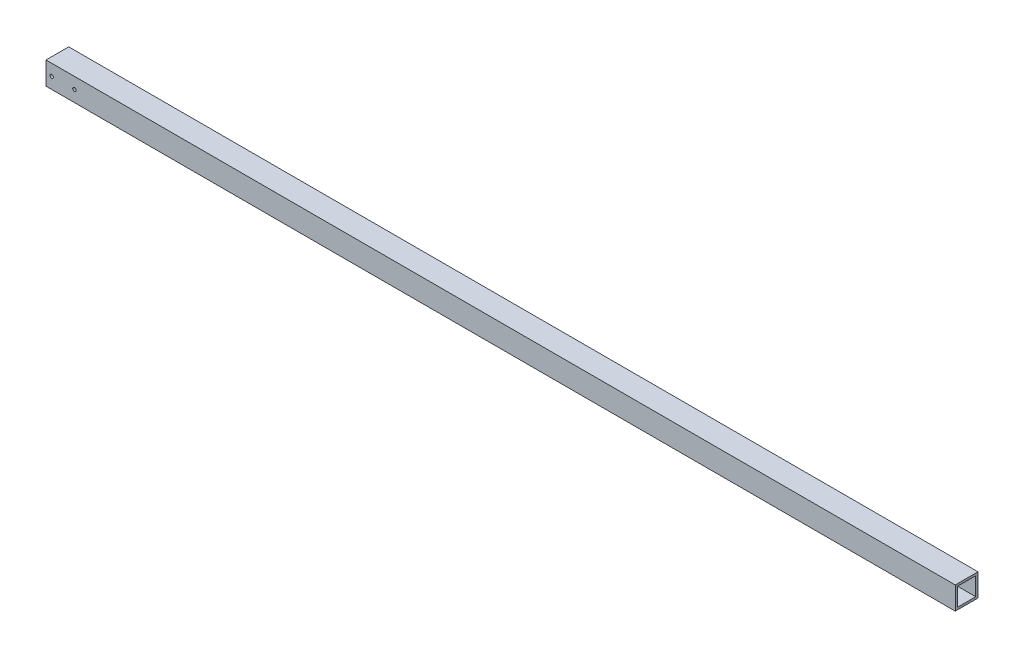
ISO-10303-21;
HEADER;
FILE_DESCRIPTION(('STEP AP214'),'2;1');
FILE_NAME('part.step','',(''),(''),'','','');
FILE_SCHEMA(('AUTOMOTIVE_DESIGN { 1 0 10303 214 1 1 1 1 }'));
ENDSEC;
DATA;
#1=APPLICATION_CONTEXT('core data for automotive mechanical design processes');
#2=APPLICATION_PROTOCOL_DEFINITION('international standard','automotive_design',2000,#1);
#3=PRODUCT_CONTEXT('',#1,'mechanical');
#4=PRODUCT('Part','Part','',(#3));
#5=PRODUCT_RELATED_PRODUCT_CATEGORY('part','',(#4));
#6=PRODUCT_DEFINITION_FORMATION('','',#4);
#7=PRODUCT_DEFINITION_CONTEXT('part definition',#1,'design');
#8=PRODUCT_DEFINITION('design','',#6,#7);
#9=PRODUCT_DEFINITION_SHAPE('','',#8);
#10=(LENGTH_UNIT() NAMED_UNIT(*) SI_UNIT(.MILLI.,.METRE.));
#11=(NAMED_UNIT(*) PLANE_ANGLE_UNIT() SI_UNIT($,.RADIAN.));
#12=(NAMED_UNIT(*) SI_UNIT($,.STERADIAN.) SOLID_ANGLE_UNIT());
#13=UNCERTAINTY_MEASURE_WITH_UNIT(LENGTH_MEASURE(1.E-05),#10,'distance_accuracy_value','');
#14=(GEOMETRIC_REPRESENTATION_CONTEXT(3) GLOBAL_UNCERTAINTY_ASSIGNED_CONTEXT((#13)) GLOBAL_UNIT_ASSIGNED_CONTEXT((#10,
#11,#12)) REPRESENTATION_CONTEXT('',''));
#15=CARTESIAN_POINT('',(0.,0.,0.));
#16=DIRECTION('',(0.,0.,1.));
#17=DIRECTION('',(1.,0.,0.));
#18=AXIS2_PLACEMENT_3D('',#15,#16,#17);
#19=CARTESIAN_POINT('',(800.,10.,-9.99999999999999));
#20=DIRECTION('',(-1.,0.,0.));
#21=DIRECTION('',(0.,0.,1.));
#22=AXIS2_PLACEMENT_3D('',#19,#20,#21);
#23=PLANE('',#22);
#24=DIRECTION('',(0.,1.,0.));
#25=VECTOR('',#24,1.);
#26=CARTESIAN_POINT('',(800.,-10.,-9.99999999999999));
#27=LINE('',#26,#25);
#28=CARTESIAN_POINT('',(800.,-10.,-9.99999999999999));
#29=VERTEX_POINT('',#28);
#30=CARTESIAN_POINT('',(800.,10.,-9.99999999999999));
#31=VERTEX_POINT('',#30);
#32=EDGE_CURVE('E136',#29,#31,#27,.T.);
#33=ORIENTED_EDGE('',*,*,#32,.T.);
#34=DIRECTION('',(0.,0.,1.));
#35=VECTOR('',#34,1.);
#36=CARTESIAN_POINT('',(800.,10.,10.));
#37=LINE('',#36,#35);
#38=CARTESIAN_POINT('',(800.,10.,10.));
#39=VERTEX_POINT('',#38);
#40=EDGE_CURVE('E139',#31,#39,#37,.T.);
#41=ORIENTED_EDGE('',*,*,#40,.T.);
#42=DIRECTION('',(0.,-1.,0.));
#43=VECTOR('',#42,1.);
#44=CARTESIAN_POINT('',(800.,-10.,10.));
#45=LINE('',#44,#43);
#46=CARTESIAN_POINT('',(800.,-10.,10.));
#47=VERTEX_POINT('',#46);
#48=EDGE_CURVE('E142',#39,#47,#45,.T.);
#49=ORIENTED_EDGE('',*,*,#48,.T.);
#50=DIRECTION('',(0.,0.,-1.));
#51=VECTOR('',#50,1.);
#52=CARTESIAN_POINT('',(800.,-10.,10.));
#53=LINE('',#52,#51);
#54=EDGE_CURVE('E144',#47,#29,#53,.T.);
#55=ORIENTED_EDGE('',*,*,#54,.T.);
#56=EDGE_LOOP('',(#33,#41,#49,#55));
#57=FACE_BOUND('',#56,.T.);
#58=DIRECTION('',(0.,1.,0.));
#59=VECTOR('',#58,1.);
#60=CARTESIAN_POINT('',(800.,-8.,-8.));
#61=LINE('',#60,#59);
#62=CARTESIAN_POINT('',(800.,-8.,-8.));
#63=VERTEX_POINT('',#62);
#64=CARTESIAN_POINT('',(800.,8.,-8.));
#65=VERTEX_POINT('',#64);
#66=EDGE_CURVE('E98',#63,#65,#61,.T.);
#67=ORIENTED_EDGE('',*,*,#66,.F.);
#68=DIRECTION('',(0.,0.,-1.));
#69=VECTOR('',#68,1.);
#70=CARTESIAN_POINT('',(800.,-8.,8.));
#71=LINE('',#70,#69);
#72=CARTESIAN_POINT('',(800.,-8.,8.));
#73=VERTEX_POINT('',#72);
#74=EDGE_CURVE('E120',#73,#63,#71,.T.);
#75=ORIENTED_EDGE('',*,*,#74,.F.);
#76=DIRECTION('',(0.,-1.,0.));
#77=VECTOR('',#76,1.);
#78=CARTESIAN_POINT('',(800.,-8.,8.));
#79=LINE('',#78,#77);
#80=CARTESIAN_POINT('',(800.,8.,8.));
#81=VERTEX_POINT('',#80);
#82=EDGE_CURVE('E118',#81,#73,#79,.T.);
#83=ORIENTED_EDGE('',*,*,#82,.F.);
#84=DIRECTION('',(0.,0.,1.));
#85=VECTOR('',#84,1.);
#86=CARTESIAN_POINT('',(800.,8.,8.));
#87=LINE('',#86,#85);
#88=EDGE_CURVE('E106',#65,#81,#87,.T.);
#89=ORIENTED_EDGE('',*,*,#88,.F.);
#90=EDGE_LOOP('',(#67,#75,#83,#89));
#91=FACE_BOUND('',#90,.T.);
#92=ADVANCED_FACE('F31',(#57,#91),#23,.F.);
#93=CARTESIAN_POINT('',(0.,10.,-9.99999999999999));
#94=DIRECTION('',(-1.,0.,0.));
#95=DIRECTION('',(0.,0.,1.));
#96=AXIS2_PLACEMENT_3D('',#93,#94,#95);
#97=PLANE('',#96);
#98=DIRECTION('',(0.,1.,0.));
#99=VECTOR('',#98,1.);
#100=CARTESIAN_POINT('',(0.,-10.,-9.99999999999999));
#101=LINE('',#100,#99);
#102=CARTESIAN_POINT('',(0.,-10.,-9.99999999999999));
#103=VERTEX_POINT('',#102);
#104=CARTESIAN_POINT('',(0.,10.,-9.99999999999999));
#105=VERTEX_POINT('',#104);
#106=EDGE_CURVE('E114',#103,#105,#101,.T.);
#107=ORIENTED_EDGE('',*,*,#106,.F.);
#108=DIRECTION('',(0.,0.,-1.));
#109=VECTOR('',#108,1.);
#110=CARTESIAN_POINT('',(0.,-10.,10.));
#111=LINE('',#110,#109);
#112=CARTESIAN_POINT('',(0.,-10.,10.));
#113=VERTEX_POINT('',#112);
#114=EDGE_CURVE('E140',#113,#103,#111,.T.);
#115=ORIENTED_EDGE('',*,*,#114,.F.);
#116=DIRECTION('',(0.,-1.,0.));
#117=VECTOR('',#116,1.);
#118=CARTESIAN_POINT('',(0.,-10.,10.));
#119=LINE('',#118,#117);
#120=CARTESIAN_POINT('',(0.,10.,10.));
#121=VERTEX_POINT('',#120);
#122=EDGE_CURVE('E151',#121,#113,#119,.T.);
#123=ORIENTED_EDGE('',*,*,#122,.F.);
#124=DIRECTION('',(0.,0.,1.));
#125=VECTOR('',#124,1.);
#126=CARTESIAN_POINT('',(0.,10.,10.));
#127=LINE('',#126,#125);
#128=EDGE_CURVE('E149',#105,#121,#127,.T.);
#129=ORIENTED_EDGE('',*,*,#128,.F.);
#130=EDGE_LOOP('',(#107,#115,#123,#129));
#131=FACE_BOUND('',#130,.T.);
#132=DIRECTION('',(0.,0.,-1.));
#133=VECTOR('',#132,1.);
#134=CARTESIAN_POINT('',(0.,-8.,8.));
#135=LINE('',#134,#133);
#136=CARTESIAN_POINT('',(0.,-8.,8.));
#137=VERTEX_POINT('',#136);
#138=CARTESIAN_POINT('',(0.,-8.,-8.));
#139=VERTEX_POINT('',#138);
#140=EDGE_CURVE('E107',#137,#139,#135,.T.);
#141=ORIENTED_EDGE('',*,*,#140,.T.);
#142=DIRECTION('',(0.,1.,0.));
#143=VECTOR('',#142,1.);
#144=CARTESIAN_POINT('',(0.,-8.,-8.));
#145=LINE('',#144,#143);
#146=CARTESIAN_POINT('',(0.,8.,-8.));
#147=VERTEX_POINT('',#146);
#148=EDGE_CURVE('E56',#139,#147,#145,.T.);
#149=ORIENTED_EDGE('',*,*,#148,.T.);
#150=DIRECTION('',(0.,0.,1.));
#151=VECTOR('',#150,1.);
#152=CARTESIAN_POINT('',(0.,8.,8.));
#153=LINE('',#152,#151);
#154=CARTESIAN_POINT('',(0.,8.,8.));
#155=VERTEX_POINT('',#154);
#156=EDGE_CURVE('E113',#147,#155,#153,.T.);
#157=ORIENTED_EDGE('',*,*,#156,.T.);
#158=DIRECTION('',(0.,-1.,0.));
#159=VECTOR('',#158,1.);
#160=CARTESIAN_POINT('',(0.,-8.,8.));
#161=LINE('',#160,#159);
#162=EDGE_CURVE('E128',#155,#137,#161,.T.);
#163=ORIENTED_EDGE('',*,*,#162,.T.);
#164=EDGE_LOOP('',(#141,#149,#157,#163));
#165=FACE_BOUND('',#164,.T.);
#166=ADVANCED_FACE('F198',(#131,#165),#97,.T.);
#167=CARTESIAN_POINT('',(800.,-10.,-9.99999999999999));
#168=DIRECTION('',(0.,0.,1.));
#169=DIRECTION('',(1.,0.,0.));
#170=AXIS2_PLACEMENT_3D('',#167,#168,#169);
#171=PLANE('',#170);
#172=CARTESIAN_POINT('',(25.,0.,-9.99999999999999));
#173=DIRECTION('',(0.,0.,1.));
#174=DIRECTION('',(1.,0.,0.));
#175=AXIS2_PLACEMENT_3D('',#172,#173,#174);
#176=CIRCLE('',#175,1.5);
#177=CARTESIAN_POINT('',(26.5,0.,-9.99999999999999));
#178=VERTEX_POINT('',#177);
#179=EDGE_CURVE('E180',#178,#178,#176,.T.);
#180=ORIENTED_EDGE('',*,*,#179,.T.);
#181=EDGE_LOOP('',(#180));
#182=FACE_BOUND('',#181,.T.);
#183=CARTESIAN_POINT('',(5.,0.,-9.99999999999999));
#184=DIRECTION('',(0.,0.,1.));
#185=DIRECTION('',(1.,0.,0.));
#186=AXIS2_PLACEMENT_3D('',#183,#184,#185);
#187=CIRCLE('',#186,1.5);
#188=CARTESIAN_POINT('',(6.5,0.,-9.99999999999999));
#189=VERTEX_POINT('',#188);
#190=EDGE_CURVE('E162',#189,#189,#187,.T.);
#191=ORIENTED_EDGE('',*,*,#190,.T.);
#192=EDGE_LOOP('',(#191));
#193=FACE_BOUND('',#192,.T.);
#194=ORIENTED_EDGE('',*,*,#106,.T.);
#195=DIRECTION('',(-1.,0.,0.));
#196=VECTOR('',#195,1.);
#197=CARTESIAN_POINT('',(800.,10.,-9.99999999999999));
#198=LINE('',#197,#196);
#199=EDGE_CURVE('E11',#31,#105,#198,.T.);
#200=ORIENTED_EDGE('',*,*,#199,.F.);
#201=ORIENTED_EDGE('',*,*,#32,.F.);
#202=DIRECTION('',(-1.,0.,0.));
#203=VECTOR('',#202,1.);
#204=CARTESIAN_POINT('',(800.,-10.,-9.99999999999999));
#205=LINE('',#204,#203);
#206=EDGE_CURVE('E146',#29,#103,#205,.T.);
#207=ORIENTED_EDGE('',*,*,#206,.T.);
#208=EDGE_LOOP('',(#194,#200,#201,#207));
#209=FACE_BOUND('',#208,.T.);
#210=ADVANCED_FACE('F33',(#182,#193,#209),#171,.F.);
#211=CARTESIAN_POINT('',(800.,10.,10.));
#212=DIRECTION('',(0.,-1.,0.));
#213=DIRECTION('',(0.,0.,-1.));
#214=AXIS2_PLACEMENT_3D('',#211,#212,#213);
#215=PLANE('',#214);
#216=ORIENTED_EDGE('',*,*,#128,.T.);
#217=DIRECTION('',(-1.,0.,0.));
#218=VECTOR('',#217,1.);
#219=CARTESIAN_POINT('',(800.,10.,10.));
#220=LINE('',#219,#218);
#221=EDGE_CURVE('E40',#39,#121,#220,.T.);
#222=ORIENTED_EDGE('',*,*,#221,.F.);
#223=ORIENTED_EDGE('',*,*,#40,.F.);
#224=ORIENTED_EDGE('',*,*,#199,.T.);
#225=EDGE_LOOP('',(#216,#222,#223,#224));
#226=FACE_BOUND('',#225,.T.);
#227=ADVANCED_FACE('F224',(#226),#215,.F.);
#228=CARTESIAN_POINT('',(800.,-10.,10.));
#229=DIRECTION('',(0.,0.,-1.));
#230=DIRECTION('',(-1.,0.,0.));
#231=AXIS2_PLACEMENT_3D('',#228,#229,#230);
#232=PLANE('',#231);
#233=CARTESIAN_POINT('',(25.,0.,10.));
#234=DIRECTION('',(0.,0.,1.));
#235=DIRECTION('',(1.,0.,0.));
#236=AXIS2_PLACEMENT_3D('',#233,#234,#235);
#237=CIRCLE('',#236,1.5);
#238=CARTESIAN_POINT('',(26.5,0.,10.));
#239=VERTEX_POINT('',#238);
#240=EDGE_CURVE('E177',#239,#239,#237,.T.);
#241=ORIENTED_EDGE('',*,*,#240,.F.);
#242=EDGE_LOOP('',(#241));
#243=FACE_BOUND('',#242,.T.);
#244=CARTESIAN_POINT('',(5.,0.,10.));
#245=DIRECTION('',(0.,0.,1.));
#246=DIRECTION('',(1.,0.,0.));
#247=AXIS2_PLACEMENT_3D('',#244,#245,#246);
#248=CIRCLE('',#247,1.5);
#249=CARTESIAN_POINT('',(6.5,0.,10.));
#250=VERTEX_POINT('',#249);
#251=EDGE_CURVE('E167',#250,#250,#248,.T.);
#252=ORIENTED_EDGE('',*,*,#251,.F.);
#253=EDGE_LOOP('',(#252));
#254=FACE_BOUND('',#253,.T.);
#255=ORIENTED_EDGE('',*,*,#122,.T.);
#256=DIRECTION('',(-1.,0.,0.));
#257=VECTOR('',#256,1.);
#258=CARTESIAN_POINT('',(800.,-10.,10.));
#259=LINE('',#258,#257);
#260=EDGE_CURVE('E156',#47,#113,#259,.T.);
#261=ORIENTED_EDGE('',*,*,#260,.F.);
#262=ORIENTED_EDGE('',*,*,#48,.F.);
#263=ORIENTED_EDGE('',*,*,#221,.T.);
#264=EDGE_LOOP('',(#255,#261,#262,#263));
#265=FACE_BOUND('',#264,.T.);
#266=ADVANCED_FACE('F221',(#243,#254,#265),#232,.F.);
#267=CARTESIAN_POINT('',(800.,-10.,10.));
#268=DIRECTION('',(0.,1.,0.));
#269=DIRECTION('',(0.,0.,1.));
#270=AXIS2_PLACEMENT_3D('',#267,#268,#269);
#271=PLANE('',#270);
#272=ORIENTED_EDGE('',*,*,#114,.T.);
#273=ORIENTED_EDGE('',*,*,#206,.F.);
#274=ORIENTED_EDGE('',*,*,#54,.F.);
#275=ORIENTED_EDGE('',*,*,#260,.T.);
#276=EDGE_LOOP('',(#272,#273,#274,#275));
#277=FACE_BOUND('',#276,.T.);
#278=ADVANCED_FACE('F218',(#277),#271,.F.);
#279=CARTESIAN_POINT('',(800.,-8.,-8.));
#280=DIRECTION('',(0.,0.,1.));
#281=DIRECTION('',(1.,0.,0.));
#282=AXIS2_PLACEMENT_3D('',#279,#280,#281);
#283=PLANE('',#282);
#284=CARTESIAN_POINT('',(25.,0.,-8.));
#285=DIRECTION('',(0.,0.,1.));
#286=DIRECTION('',(1.,0.,0.));
#287=AXIS2_PLACEMENT_3D('',#284,#285,#286);
#288=CIRCLE('',#287,1.5);
#289=CARTESIAN_POINT('',(26.5,0.,-8.));
#290=VERTEX_POINT('',#289);
#291=EDGE_CURVE('E172',#290,#290,#288,.T.);
#292=ORIENTED_EDGE('',*,*,#291,.F.);
#293=EDGE_LOOP('',(#292));
#294=FACE_BOUND('',#293,.T.);
#295=CARTESIAN_POINT('',(5.,0.,-8.));
#296=DIRECTION('',(0.,0.,1.));
#297=DIRECTION('',(1.,0.,0.));
#298=AXIS2_PLACEMENT_3D('',#295,#296,#297);
#299=CIRCLE('',#298,1.5);
#300=CARTESIAN_POINT('',(6.5,0.,-8.));
#301=VERTEX_POINT('',#300);
#302=EDGE_CURVE('E126',#301,#301,#299,.T.);
#303=ORIENTED_EDGE('',*,*,#302,.F.);
#304=EDGE_LOOP('',(#303));
#305=FACE_BOUND('',#304,.T.);
#306=ORIENTED_EDGE('',*,*,#148,.F.);
#307=DIRECTION('',(-1.,0.,0.));
#308=VECTOR('',#307,1.);
#309=CARTESIAN_POINT('',(800.,-8.,-8.));
#310=LINE('',#309,#308);
#311=EDGE_CURVE('E102',#63,#139,#310,.T.);
#312=ORIENTED_EDGE('',*,*,#311,.F.);
#313=ORIENTED_EDGE('',*,*,#66,.T.);
#314=DIRECTION('',(-1.,0.,0.));
#315=VECTOR('',#314,1.);
#316=CARTESIAN_POINT('',(800.,8.,-8.));
#317=LINE('',#316,#315);
#318=EDGE_CURVE('E101',#65,#147,#317,.T.);
#319=ORIENTED_EDGE('',*,*,#318,.T.);
#320=EDGE_LOOP('',(#306,#312,#313,#319));
#321=FACE_BOUND('',#320,.T.);
#322=ADVANCED_FACE('F100',(#294,#305,#321),#283,.T.);
#323=CARTESIAN_POINT('',(800.,8.,8.));
#324=DIRECTION('',(0.,-1.,0.));
#325=DIRECTION('',(0.,0.,-1.));
#326=AXIS2_PLACEMENT_3D('',#323,#324,#325);
#327=PLANE('',#326);
#328=ORIENTED_EDGE('',*,*,#156,.F.);
#329=ORIENTED_EDGE('',*,*,#318,.F.);
#330=ORIENTED_EDGE('',*,*,#88,.T.);
#331=DIRECTION('',(-1.,0.,0.));
#332=VECTOR('',#331,1.);
#333=CARTESIAN_POINT('',(800.,8.,8.));
#334=LINE('',#333,#332);
#335=EDGE_CURVE('E115',#81,#155,#334,.T.);
#336=ORIENTED_EDGE('',*,*,#335,.T.);
#337=EDGE_LOOP('',(#328,#329,#330,#336));
#338=FACE_BOUND('',#337,.T.);
#339=ADVANCED_FACE('F110',(#338),#327,.T.);
#340=CARTESIAN_POINT('',(800.,-8.,8.));
#341=DIRECTION('',(0.,0.,-1.));
#342=DIRECTION('',(-1.,0.,0.));
#343=AXIS2_PLACEMENT_3D('',#340,#341,#342);
#344=PLANE('',#343);
#345=CARTESIAN_POINT('',(25.,0.,8.));
#346=DIRECTION('',(0.,0.,-1.));
#347=DIRECTION('',(-1.,0.,0.));
#348=AXIS2_PLACEMENT_3D('',#345,#346,#347);
#349=CIRCLE('',#348,1.5);
#350=CARTESIAN_POINT('',(23.5,0.,8.));
#351=VERTEX_POINT('',#350);
#352=EDGE_CURVE('E35',#351,#351,#349,.T.);
#353=ORIENTED_EDGE('',*,*,#352,.F.);
#354=EDGE_LOOP('',(#353));
#355=FACE_BOUND('',#354,.T.);
#356=CARTESIAN_POINT('',(5.,0.,8.));
#357=DIRECTION('',(0.,0.,-1.));
#358=DIRECTION('',(-1.,0.,0.));
#359=AXIS2_PLACEMENT_3D('',#356,#357,#358);
#360=CIRCLE('',#359,1.5);
#361=CARTESIAN_POINT('',(3.5,0.,8.));
#362=VERTEX_POINT('',#361);
#363=EDGE_CURVE('E160',#362,#362,#360,.T.);
#364=ORIENTED_EDGE('',*,*,#363,.F.);
#365=EDGE_LOOP('',(#364));
#366=FACE_BOUND('',#365,.T.);
#367=ORIENTED_EDGE('',*,*,#162,.F.);
#368=ORIENTED_EDGE('',*,*,#335,.F.);
#369=ORIENTED_EDGE('',*,*,#82,.T.);
#370=DIRECTION('',(-1.,0.,0.));
#371=VECTOR('',#370,1.);
#372=CARTESIAN_POINT('',(800.,-8.,8.));
#373=LINE('',#372,#371);
#374=EDGE_CURVE('E48',#73,#137,#373,.T.);
#375=ORIENTED_EDGE('',*,*,#374,.T.);
#376=EDGE_LOOP('',(#367,#368,#369,#375));
#377=FACE_BOUND('',#376,.T.);
#378=ADVANCED_FACE('F190',(#355,#366,#377),#344,.T.);
#379=CARTESIAN_POINT('',(800.,-8.,8.));
#380=DIRECTION('',(0.,1.,0.));
#381=DIRECTION('',(0.,0.,1.));
#382=AXIS2_PLACEMENT_3D('',#379,#380,#381);
#383=PLANE('',#382);
#384=ORIENTED_EDGE('',*,*,#140,.F.);
#385=ORIENTED_EDGE('',*,*,#374,.F.);
#386=ORIENTED_EDGE('',*,*,#74,.T.);
#387=ORIENTED_EDGE('',*,*,#311,.T.);
#388=EDGE_LOOP('',(#384,#385,#386,#387));
#389=FACE_BOUND('',#388,.T.);
#390=ADVANCED_FACE('F193',(#389),#383,.T.);
#391=CARTESIAN_POINT('',(5.,0.,-9.99999999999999));
#392=DIRECTION('',(0.,0.,1.));
#393=DIRECTION('',(1.,0.,0.));
#394=AXIS2_PLACEMENT_3D('',#391,#392,#393);
#395=CYLINDRICAL_SURFACE('',#394,1.5);
#396=ORIENTED_EDGE('',*,*,#363,.T.);
#397=EDGE_LOOP('',(#396));
#398=FACE_BOUND('',#397,.T.);
#399=ORIENTED_EDGE('',*,*,#251,.T.);
#400=EDGE_LOOP('',(#399));
#401=FACE_BOUND('',#400,.T.);
#402=ADVANCED_FACE('F200',(#398,#401),#395,.F.);
#403=ORIENTED_EDGE('',*,*,#302,.T.);
#404=EDGE_LOOP('',(#403));
#405=FACE_BOUND('',#404,.T.);
#406=ORIENTED_EDGE('',*,*,#190,.F.);
#407=EDGE_LOOP('',(#406));
#408=FACE_BOUND('',#407,.T.);
#409=ADVANCED_FACE('F205',(#405,#408),#395,.F.);
#410=CARTESIAN_POINT('',(25.,0.,-9.99999999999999));
#411=DIRECTION('',(0.,0.,1.));
#412=DIRECTION('',(1.,0.,0.));
#413=AXIS2_PLACEMENT_3D('',#410,#411,#412);
#414=CYLINDRICAL_SURFACE('',#413,1.5);
#415=ORIENTED_EDGE('',*,*,#352,.T.);
#416=EDGE_LOOP('',(#415));
#417=FACE_BOUND('',#416,.T.);
#418=ORIENTED_EDGE('',*,*,#240,.T.);
#419=EDGE_LOOP('',(#418));
#420=FACE_BOUND('',#419,.T.);
#421=ADVANCED_FACE('F187',(#417,#420),#414,.F.);
#422=ORIENTED_EDGE('',*,*,#291,.T.);
#423=EDGE_LOOP('',(#422));
#424=FACE_BOUND('',#423,.T.);
#425=ORIENTED_EDGE('',*,*,#179,.F.);
#426=EDGE_LOOP('',(#425));
#427=FACE_BOUND('',#426,.T.);
#428=ADVANCED_FACE('F300',(#424,#427),#414,.F.);
#429=CLOSED_SHELL('',(#92,#166,#210,#227,#266,#278,#322,#339,#378,#390,#402,#409,#421,#428));
#430=MANIFOLD_SOLID_BREP('B2',#429);
#431=ADVANCED_BREP_SHAPE_REPRESENTATION('',(#18,#430),#14);
#432=SHAPE_DEFINITION_REPRESENTATION(#9,#431);
ENDSEC;
END-ISO-10303-21;
